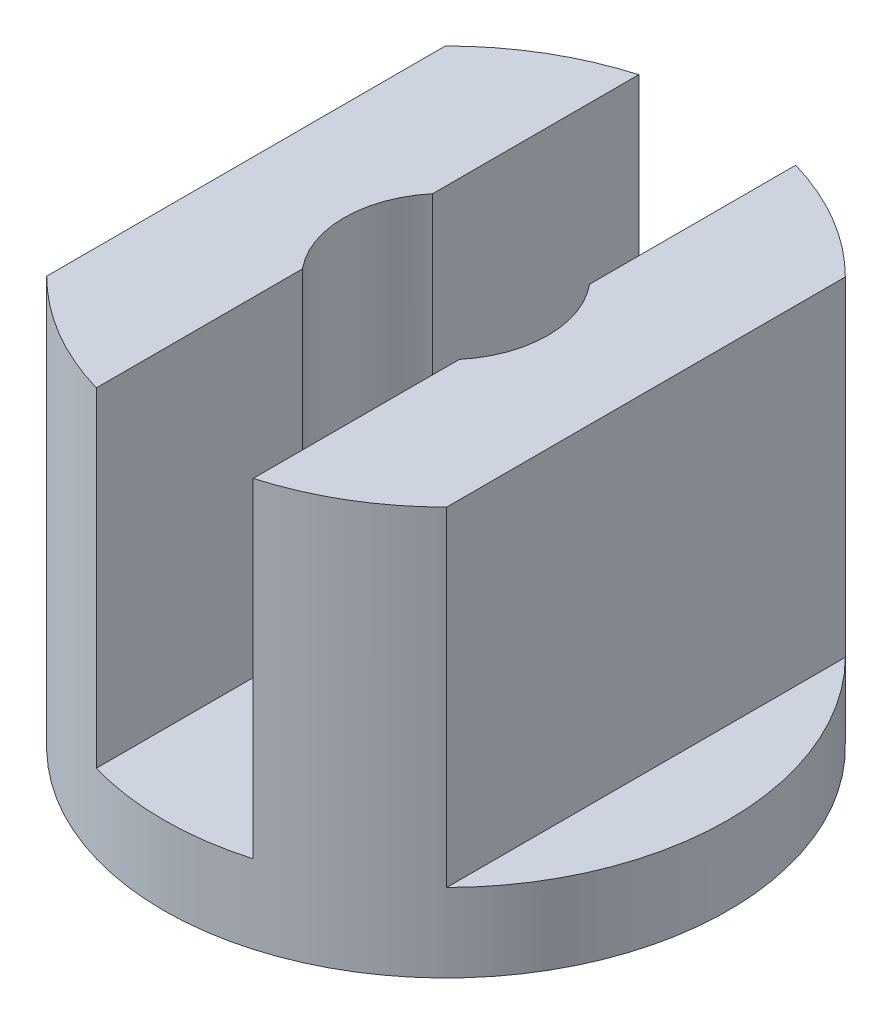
ISO-10303-21;
HEADER;
FILE_DESCRIPTION(('STEP AP214'),'2;1');
FILE_NAME('part.step','',(''),(''),'','','');
FILE_SCHEMA(('AUTOMOTIVE_DESIGN { 1 0 10303 214 1 1 1 1 }'));
ENDSEC;
DATA;
#1=APPLICATION_CONTEXT('core data for automotive mechanical design processes');
#2=APPLICATION_PROTOCOL_DEFINITION('international standard','automotive_design',2000,#1);
#3=PRODUCT_CONTEXT('',#1,'mechanical');
#4=PRODUCT('Part','Part','',(#3));
#5=PRODUCT_RELATED_PRODUCT_CATEGORY('part','',(#4));
#6=PRODUCT_DEFINITION_FORMATION('','',#4);
#7=PRODUCT_DEFINITION_CONTEXT('part definition',#1,'design');
#8=PRODUCT_DEFINITION('design','',#6,#7);
#9=PRODUCT_DEFINITION_SHAPE('','',#8);
#10=(LENGTH_UNIT() NAMED_UNIT(*) SI_UNIT(.MILLI.,.METRE.));
#11=(NAMED_UNIT(*) PLANE_ANGLE_UNIT() SI_UNIT($,.RADIAN.));
#12=(NAMED_UNIT(*) SI_UNIT($,.STERADIAN.) SOLID_ANGLE_UNIT());
#13=UNCERTAINTY_MEASURE_WITH_UNIT(LENGTH_MEASURE(1.E-05),#10,'distance_accuracy_value','');
#14=(GEOMETRIC_REPRESENTATION_CONTEXT(3) GLOBAL_UNCERTAINTY_ASSIGNED_CONTEXT((#13)) GLOBAL_UNIT_ASSIGNED_CONTEXT((#10,
#11,#12)) REPRESENTATION_CONTEXT('',''));
#15=CARTESIAN_POINT('',(0.,0.,0.));
#16=DIRECTION('',(0.,0.,1.));
#17=DIRECTION('',(1.,0.,0.));
#18=AXIS2_PLACEMENT_3D('',#15,#16,#17);
#19=CARTESIAN_POINT('',(-20.,20.,-75.));
#20=DIRECTION('',(0.,-1.,0.));
#21=DIRECTION('',(0.,0.,-1.));
#22=AXIS2_PLACEMENT_3D('',#19,#20,#21);
#23=PLANE('',#22);
#24=DIRECTION('',(0.,0.,1.));
#25=VECTOR('',#24,1.);
#26=CARTESIAN_POINT('',(20.,20.,-75.));
#27=LINE('',#26,#25);
#28=CARTESIAN_POINT('',(20.,20.,16.6132477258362));
#29=VERTEX_POINT('',#28);
#30=CARTESIAN_POINT('',(20.,20.,69.1664658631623));
#31=VERTEX_POINT('',#30);
#32=EDGE_CURVE('E233',#29,#31,#27,.T.);
#33=ORIENTED_EDGE('',*,*,#32,.F.);
#34=CARTESIAN_POINT('',(0.,20.,0.));
#35=DIRECTION('',(0.,-1.,0.));
#36=DIRECTION('',(0.,0.,-1.));
#37=AXIS2_PLACEMENT_3D('',#34,#35,#36);
#38=CIRCLE('',#37,26.);
#39=CARTESIAN_POINT('',(-20.,20.,16.6132477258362));
#40=VERTEX_POINT('',#39);
#41=EDGE_CURVE('E191',#29,#40,#38,.T.);
#42=ORIENTED_EDGE('',*,*,#41,.T.);
#43=DIRECTION('',(0.,0.,1.));
#44=VECTOR('',#43,1.);
#45=CARTESIAN_POINT('',(-20.,20.,-75.));
#46=LINE('',#45,#44);
#47=CARTESIAN_POINT('',(-20.,20.,69.1664658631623));
#48=VERTEX_POINT('',#47);
#49=EDGE_CURVE('E192',#40,#48,#46,.T.);
#50=ORIENTED_EDGE('',*,*,#49,.T.);
#51=CARTESIAN_POINT('',(0.,20.,0.));
#52=DIRECTION('',(0.,1.,0.));
#53=DIRECTION('',(0.,0.,1.));
#54=AXIS2_PLACEMENT_3D('',#51,#52,#53);
#55=CIRCLE('',#54,72.);
#56=EDGE_CURVE('E161',#48,#31,#55,.T.);
#57=ORIENTED_EDGE('',*,*,#56,.T.);
#58=EDGE_LOOP('',(#33,#42,#50,#57));
#59=FACE_BOUND('',#58,.T.);
#60=ADVANCED_FACE('F34',(#59),#23,.F.);
#61=CARTESIAN_POINT('',(-20.,104.,-75.));
#62=DIRECTION('',(-1.,0.,0.));
#63=DIRECTION('',(0.,-1.,0.));
#64=AXIS2_PLACEMENT_3D('',#61,#62,#63);
#65=PLANE('',#64);
#66=DIRECTION('',(0.,0.,1.));
#67=VECTOR('',#66,1.);
#68=CARTESIAN_POINT('',(-20.,104.,-75.));
#69=LINE('',#68,#67);
#70=CARTESIAN_POINT('',(-20.,104.,16.6132477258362));
#71=VERTEX_POINT('',#70);
#72=CARTESIAN_POINT('',(-20.,104.,69.1664658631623));
#73=VERTEX_POINT('',#72);
#74=EDGE_CURVE('E228',#71,#73,#69,.T.);
#75=ORIENTED_EDGE('',*,*,#74,.T.);
#76=DIRECTION('',(0.,-1.,0.));
#77=VECTOR('',#76,1.);
#78=CARTESIAN_POINT('',(-20.,104.,69.1664658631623));
#79=LINE('',#78,#77);
#80=EDGE_CURVE('E211',#73,#48,#79,.T.);
#81=ORIENTED_EDGE('',*,*,#80,.T.);
#82=ORIENTED_EDGE('',*,*,#49,.F.);
#83=DIRECTION('',(0.,1.,0.));
#84=VECTOR('',#83,1.);
#85=CARTESIAN_POINT('',(-20.,0.,16.6132477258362));
#86=LINE('',#85,#84);
#87=EDGE_CURVE('E189',#40,#71,#86,.T.);
#88=ORIENTED_EDGE('',*,*,#87,.T.);
#89=EDGE_LOOP('',(#75,#81,#82,#88));
#90=FACE_BOUND('',#89,.T.);
#91=ADVANCED_FACE('F246',(#90),#65,.F.);
#92=CARTESIAN_POINT('',(20.,104.,-75.));
#93=DIRECTION('',(1.,0.,0.));
#94=DIRECTION('',(0.,1.,0.));
#95=AXIS2_PLACEMENT_3D('',#92,#93,#94);
#96=PLANE('',#95);
#97=DIRECTION('',(0.,0.,1.));
#98=VECTOR('',#97,1.);
#99=CARTESIAN_POINT('',(20.,104.,-75.));
#100=LINE('',#99,#98);
#101=CARTESIAN_POINT('',(20.,104.,-69.1664658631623));
#102=VERTEX_POINT('',#101);
#103=CARTESIAN_POINT('',(20.,104.,-16.6132477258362));
#104=VERTEX_POINT('',#103);
#105=EDGE_CURVE('E171',#102,#104,#100,.T.);
#106=ORIENTED_EDGE('',*,*,#105,.F.);
#107=DIRECTION('',(0.,-1.,0.));
#108=VECTOR('',#107,1.);
#109=CARTESIAN_POINT('',(20.,104.,-69.1664658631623));
#110=LINE('',#109,#108);
#111=CARTESIAN_POINT('',(20.,20.,-69.1664658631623));
#112=VERTEX_POINT('',#111);
#113=EDGE_CURVE('E209',#102,#112,#110,.T.);
#114=ORIENTED_EDGE('',*,*,#113,.T.);
#115=CARTESIAN_POINT('',(20.,20.,-16.6132477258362));
#116=VERTEX_POINT('',#115);
#117=EDGE_CURVE('E173',#112,#116,#27,.T.);
#118=ORIENTED_EDGE('',*,*,#117,.T.);
#119=DIRECTION('',(0.,1.,0.));
#120=VECTOR('',#119,1.);
#121=CARTESIAN_POINT('',(20.,0.,-16.6132477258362));
#122=LINE('',#121,#120);
#123=EDGE_CURVE('E42',#116,#104,#122,.T.);
#124=ORIENTED_EDGE('',*,*,#123,.T.);
#125=EDGE_LOOP('',(#106,#114,#118,#124));
#126=FACE_BOUND('',#125,.T.);
#127=ADVANCED_FACE('F170',(#126),#96,.F.);
#128=CARTESIAN_POINT('',(-51.,104.,75.));
#129=DIRECTION('',(0.,1.,0.));
#130=DIRECTION('',(0.,0.,1.));
#131=AXIS2_PLACEMENT_3D('',#128,#129,#130);
#132=PLANE('',#131);
#133=CARTESIAN_POINT('',(0.,104.,0.));
#134=DIRECTION('',(0.,1.,0.));
#135=DIRECTION('',(0.,0.,1.));
#136=AXIS2_PLACEMENT_3D('',#133,#134,#135);
#137=CIRCLE('',#136,72.);
#138=CARTESIAN_POINT('',(-51.,104.,50.8232230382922));
#139=VERTEX_POINT('',#138);
#140=EDGE_CURVE('E49',#139,#73,#137,.T.);
#141=ORIENTED_EDGE('',*,*,#140,.T.);
#142=ORIENTED_EDGE('',*,*,#74,.F.);
#143=CARTESIAN_POINT('',(0.,104.,0.));
#144=DIRECTION('',(0.,1.,0.));
#145=DIRECTION('',(0.,0.,1.));
#146=AXIS2_PLACEMENT_3D('',#143,#144,#145);
#147=CIRCLE('',#146,26.);
#148=CARTESIAN_POINT('',(-20.,104.,-16.6132477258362));
#149=VERTEX_POINT('',#148);
#150=EDGE_CURVE('E206',#149,#71,#147,.T.);
#151=ORIENTED_EDGE('',*,*,#150,.F.);
#152=CARTESIAN_POINT('',(-20.,104.,-69.1664658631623));
#153=VERTEX_POINT('',#152);
#154=EDGE_CURVE('E151',#153,#149,#69,.T.);
#155=ORIENTED_EDGE('',*,*,#154,.F.);
#156=CARTESIAN_POINT('',(-51.,104.,-50.8232230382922));
#157=VERTEX_POINT('',#156);
#158=EDGE_CURVE('E225',#153,#157,#137,.T.);
#159=ORIENTED_EDGE('',*,*,#158,.T.);
#160=DIRECTION('',(0.,0.,1.));
#161=VECTOR('',#160,1.);
#162=CARTESIAN_POINT('',(-51.,104.,75.));
#163=LINE('',#162,#161);
#164=EDGE_CURVE('E144',#157,#139,#163,.T.);
#165=ORIENTED_EDGE('',*,*,#164,.T.);
#166=EDGE_LOOP('',(#141,#142,#151,#155,#159,#165));
#167=FACE_BOUND('',#166,.T.);
#168=ADVANCED_FACE('F224',(#167),#132,.T.);
#169=CARTESIAN_POINT('',(0.,20.,0.));
#170=DIRECTION('',(0.,1.,0.));
#171=DIRECTION('',(0.,0.,1.));
#172=AXIS2_PLACEMENT_3D('',#169,#170,#171);
#173=PLANE('',#172);
#174=CARTESIAN_POINT('',(-51.,20.,-50.8232230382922));
#175=VERTEX_POINT('',#174);
#176=CARTESIAN_POINT('',(-51.,20.,50.8232230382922));
#177=VERTEX_POINT('',#176);
#178=EDGE_CURVE('E160',#175,#177,#55,.T.);
#179=ORIENTED_EDGE('',*,*,#178,.T.);
#180=DIRECTION('',(0.,0.,-1.));
#181=VECTOR('',#180,1.);
#182=CARTESIAN_POINT('',(-51.,20.,75.));
#183=LINE('',#182,#181);
#184=EDGE_CURVE('E156',#177,#175,#183,.T.);
#185=ORIENTED_EDGE('',*,*,#184,.T.);
#186=EDGE_LOOP('',(#179,#185));
#187=FACE_BOUND('',#186,.T.);
#188=ADVANCED_FACE('F242',(#187),#173,.T.);
#189=CARTESIAN_POINT('',(0.,20.,0.));
#190=DIRECTION('',(0.,-1.,0.));
#191=DIRECTION('',(0.,0.,-1.));
#192=AXIS2_PLACEMENT_3D('',#189,#190,#191);
#193=CYLINDRICAL_SURFACE('',#192,72.);
#194=CARTESIAN_POINT('',(51.,20.,50.8232230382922));
#195=VERTEX_POINT('',#194);
#196=CARTESIAN_POINT('',(51.,20.,-50.8232230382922));
#197=VERTEX_POINT('',#196);
#198=EDGE_CURVE('E125',#195,#197,#55,.T.);
#199=ORIENTED_EDGE('',*,*,#198,.F.);
#200=DIRECTION('',(0.,-1.,0.));
#201=VECTOR('',#200,1.);
#202=CARTESIAN_POINT('',(51.,104.,50.8232230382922));
#203=LINE('',#202,#201);
#204=CARTESIAN_POINT('',(51.,104.,50.8232230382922));
#205=VERTEX_POINT('',#204);
#206=EDGE_CURVE('E120',#205,#195,#203,.T.);
#207=ORIENTED_EDGE('',*,*,#206,.F.);
#208=CARTESIAN_POINT('',(20.,104.,69.1664658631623));
#209=VERTEX_POINT('',#208);
#210=EDGE_CURVE('E123',#209,#205,#137,.T.);
#211=ORIENTED_EDGE('',*,*,#210,.F.);
#212=DIRECTION('',(0.,-1.,0.));
#213=VECTOR('',#212,1.);
#214=CARTESIAN_POINT('',(20.,104.,69.1664658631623));
#215=LINE('',#214,#213);
#216=EDGE_CURVE('E13',#31,#209,#215,.F.);
#217=ORIENTED_EDGE('',*,*,#216,.F.);
#218=ORIENTED_EDGE('',*,*,#56,.F.);
#219=ORIENTED_EDGE('',*,*,#80,.F.);
#220=ORIENTED_EDGE('',*,*,#140,.F.);
#221=DIRECTION('',(0.,-1.,0.));
#222=VECTOR('',#221,1.);
#223=CARTESIAN_POINT('',(-51.,104.,50.8232230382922));
#224=LINE('',#223,#222);
#225=EDGE_CURVE('E130',#139,#177,#224,.T.);
#226=ORIENTED_EDGE('',*,*,#225,.T.);
#227=ORIENTED_EDGE('',*,*,#178,.F.);
#228=DIRECTION('',(0.,-1.,0.));
#229=VECTOR('',#228,1.);
#230=CARTESIAN_POINT('',(-51.,104.,-50.8232230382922));
#231=LINE('',#230,#229);
#232=EDGE_CURVE('E213',#175,#157,#231,.F.);
#233=ORIENTED_EDGE('',*,*,#232,.T.);
#234=ORIENTED_EDGE('',*,*,#158,.F.);
#235=DIRECTION('',(0.,-1.,0.));
#236=VECTOR('',#235,1.);
#237=CARTESIAN_POINT('',(-20.,104.,-69.1664658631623));
#238=LINE('',#237,#236);
#239=CARTESIAN_POINT('',(-20.,20.,-69.1664658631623));
#240=VERTEX_POINT('',#239);
#241=EDGE_CURVE('E131',#240,#153,#238,.F.);
#242=ORIENTED_EDGE('',*,*,#241,.F.);
#243=CARTESIAN_POINT('',(0.,20.,0.));
#244=DIRECTION('',(0.,-1.,0.));
#245=DIRECTION('',(0.,0.,-1.));
#246=AXIS2_PLACEMENT_3D('',#243,#244,#245);
#247=CIRCLE('',#246,72.);
#248=EDGE_CURVE('E145',#240,#112,#247,.T.);
#249=ORIENTED_EDGE('',*,*,#248,.T.);
#250=ORIENTED_EDGE('',*,*,#113,.F.);
#251=CARTESIAN_POINT('',(51.,104.,-50.8232230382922));
#252=VERTEX_POINT('',#251);
#253=EDGE_CURVE('E56',#252,#102,#137,.T.);
#254=ORIENTED_EDGE('',*,*,#253,.F.);
#255=DIRECTION('',(0.,-1.,0.));
#256=VECTOR('',#255,1.);
#257=CARTESIAN_POINT('',(51.,104.,-50.8232230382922));
#258=LINE('',#257,#256);
#259=EDGE_CURVE('E141',#197,#252,#258,.F.);
#260=ORIENTED_EDGE('',*,*,#259,.F.);
#261=EDGE_LOOP('',(#199,#207,#211,#217,#218,#219,#220,#226,#227,#233,#234,#242,#249,#250,#254,#260));
#262=FACE_BOUND('',#261,.T.);
#263=CARTESIAN_POINT('',(0.,0.,0.));
#264=DIRECTION('',(0.,1.,0.));
#265=DIRECTION('',(0.,0.,1.));
#266=AXIS2_PLACEMENT_3D('',#263,#264,#265);
#267=CIRCLE('',#266,72.);
#268=CARTESIAN_POINT('',(0.,0.,72.));
#269=VERTEX_POINT('',#268);
#270=EDGE_CURVE('E148',#269,#269,#267,.T.);
#271=ORIENTED_EDGE('',*,*,#270,.T.);
#272=EDGE_LOOP('',(#271));
#273=FACE_BOUND('',#272,.T.);
#274=ADVANCED_FACE('F36',(#262,#273),#193,.T.);
#275=DIRECTION('',(0.,0.,-1.));
#276=VECTOR('',#275,1.);
#277=CARTESIAN_POINT('',(51.,20.,75.));
#278=LINE('',#277,#276);
#279=EDGE_CURVE('E155',#195,#197,#278,.T.);
#280=ORIENTED_EDGE('',*,*,#279,.F.);
#281=ORIENTED_EDGE('',*,*,#198,.T.);
#282=EDGE_LOOP('',(#280,#281));
#283=FACE_BOUND('',#282,.T.);
#284=ADVANCED_FACE('F277',(#283),#173,.T.);
#285=CARTESIAN_POINT('',(0.,0.,0.));
#286=DIRECTION('',(0.,1.,0.));
#287=DIRECTION('',(0.,0.,1.));
#288=AXIS2_PLACEMENT_3D('',#285,#286,#287);
#289=PLANE('',#288);
#290=CARTESIAN_POINT('',(0.,0.,0.));
#291=DIRECTION('',(0.,1.,0.));
#292=DIRECTION('',(0.,0.,1.));
#293=AXIS2_PLACEMENT_3D('',#290,#291,#292);
#294=CIRCLE('',#293,26.);
#295=CARTESIAN_POINT('',(0.,0.,26.));
#296=VERTEX_POINT('',#295);
#297=EDGE_CURVE('E198',#296,#296,#294,.T.);
#298=ORIENTED_EDGE('',*,*,#297,.T.);
#299=EDGE_LOOP('',(#298));
#300=FACE_BOUND('',#299,.T.);
#301=ORIENTED_EDGE('',*,*,#270,.F.);
#302=EDGE_LOOP('',(#301));
#303=FACE_BOUND('',#302,.T.);
#304=ADVANCED_FACE('F276',(#300,#303),#289,.F.);
#305=ORIENTED_EDGE('',*,*,#253,.T.);
#306=ORIENTED_EDGE('',*,*,#105,.T.);
#307=CARTESIAN_POINT('',(20.,104.,16.6132477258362));
#308=VERTEX_POINT('',#307);
#309=EDGE_CURVE('E181',#308,#104,#147,.T.);
#310=ORIENTED_EDGE('',*,*,#309,.F.);
#311=EDGE_CURVE('E140',#308,#209,#100,.T.);
#312=ORIENTED_EDGE('',*,*,#311,.T.);
#313=ORIENTED_EDGE('',*,*,#210,.T.);
#314=DIRECTION('',(0.,0.,1.));
#315=VECTOR('',#314,1.);
#316=CARTESIAN_POINT('',(51.,104.,75.));
#317=LINE('',#316,#315);
#318=EDGE_CURVE('E137',#252,#205,#317,.T.);
#319=ORIENTED_EDGE('',*,*,#318,.F.);
#320=EDGE_LOOP('',(#305,#306,#310,#312,#313,#319));
#321=FACE_BOUND('',#320,.T.);
#322=ADVANCED_FACE('F136',(#321),#132,.T.);
#323=CARTESIAN_POINT('',(-51.,20.,75.));
#324=DIRECTION('',(-1.,0.,0.));
#325=DIRECTION('',(0.,0.,1.));
#326=AXIS2_PLACEMENT_3D('',#323,#324,#325);
#327=PLANE('',#326);
#328=ORIENTED_EDGE('',*,*,#232,.F.);
#329=ORIENTED_EDGE('',*,*,#184,.F.);
#330=ORIENTED_EDGE('',*,*,#225,.F.);
#331=ORIENTED_EDGE('',*,*,#164,.F.);
#332=EDGE_LOOP('',(#328,#329,#330,#331));
#333=FACE_BOUND('',#332,.T.);
#334=ADVANCED_FACE('F245',(#333),#327,.T.);
#335=CARTESIAN_POINT('',(51.,20.,75.));
#336=DIRECTION('',(-1.,0.,0.));
#337=DIRECTION('',(0.,0.,1.));
#338=AXIS2_PLACEMENT_3D('',#335,#336,#337);
#339=PLANE('',#338);
#340=ORIENTED_EDGE('',*,*,#279,.T.);
#341=ORIENTED_EDGE('',*,*,#259,.T.);
#342=ORIENTED_EDGE('',*,*,#318,.T.);
#343=ORIENTED_EDGE('',*,*,#206,.T.);
#344=EDGE_LOOP('',(#340,#341,#342,#343));
#345=FACE_BOUND('',#344,.T.);
#346=ADVANCED_FACE('F143',(#345),#339,.F.);
#347=CARTESIAN_POINT('',(-20.,20.,-16.6132477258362));
#348=VERTEX_POINT('',#347);
#349=EDGE_CURVE('E187',#240,#348,#46,.T.);
#350=ORIENTED_EDGE('',*,*,#349,.T.);
#351=EDGE_CURVE('E179',#348,#116,#38,.T.);
#352=ORIENTED_EDGE('',*,*,#351,.T.);
#353=ORIENTED_EDGE('',*,*,#117,.F.);
#354=ORIENTED_EDGE('',*,*,#248,.F.);
#355=EDGE_LOOP('',(#350,#352,#353,#354));
#356=FACE_BOUND('',#355,.T.);
#357=ADVANCED_FACE('F184',(#356),#23,.F.);
#358=ORIENTED_EDGE('',*,*,#349,.F.);
#359=ORIENTED_EDGE('',*,*,#241,.T.);
#360=ORIENTED_EDGE('',*,*,#154,.T.);
#361=DIRECTION('',(0.,1.,0.));
#362=VECTOR('',#361,1.);
#363=CARTESIAN_POINT('',(-20.,0.,-16.6132477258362));
#364=LINE('',#363,#362);
#365=EDGE_CURVE('E188',#149,#348,#364,.F.);
#366=ORIENTED_EDGE('',*,*,#365,.T.);
#367=EDGE_LOOP('',(#358,#359,#360,#366));
#368=FACE_BOUND('',#367,.T.);
#369=ADVANCED_FACE('F220',(#368),#65,.F.);
#370=ORIENTED_EDGE('',*,*,#32,.T.);
#371=ORIENTED_EDGE('',*,*,#216,.T.);
#372=ORIENTED_EDGE('',*,*,#311,.F.);
#373=DIRECTION('',(0.,1.,0.));
#374=VECTOR('',#373,1.);
#375=CARTESIAN_POINT('',(20.,0.,16.6132477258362));
#376=LINE('',#375,#374);
#377=EDGE_CURVE('E164',#308,#29,#376,.F.);
#378=ORIENTED_EDGE('',*,*,#377,.T.);
#379=EDGE_LOOP('',(#370,#371,#372,#378));
#380=FACE_BOUND('',#379,.T.);
#381=ADVANCED_FACE('F248',(#380),#96,.F.);
#382=CARTESIAN_POINT('',(0.,0.,0.));
#383=DIRECTION('',(0.,1.,0.));
#384=DIRECTION('',(0.,0.,1.));
#385=AXIS2_PLACEMENT_3D('',#382,#383,#384);
#386=CYLINDRICAL_SURFACE('',#385,26.);
#387=ORIENTED_EDGE('',*,*,#297,.F.);
#388=EDGE_LOOP('',(#387));
#389=FACE_BOUND('',#388,.T.);
#390=ORIENTED_EDGE('',*,*,#150,.T.);
#391=ORIENTED_EDGE('',*,*,#87,.F.);
#392=ORIENTED_EDGE('',*,*,#41,.F.);
#393=ORIENTED_EDGE('',*,*,#377,.F.);
#394=ORIENTED_EDGE('',*,*,#309,.T.);
#395=ORIENTED_EDGE('',*,*,#123,.F.);
#396=ORIENTED_EDGE('',*,*,#351,.F.);
#397=ORIENTED_EDGE('',*,*,#365,.F.);
#398=EDGE_LOOP('',(#390,#391,#392,#393,#394,#395,#396,#397));
#399=FACE_BOUND('',#398,.T.);
#400=ADVANCED_FACE('F177',(#389,#399),#386,.F.);
#401=CLOSED_SHELL('',(#60,#91,#127,#168,#188,#274,#284,#304,#322,#334,#346,#357,#369,#381,#400));
#402=MANIFOLD_SOLID_BREP('B2',#401);
#403=ADVANCED_BREP_SHAPE_REPRESENTATION('',(#18,#402),#14);
#404=SHAPE_DEFINITION_REPRESENTATION(#9,#403);
ENDSEC;
END-ISO-10303-21;
